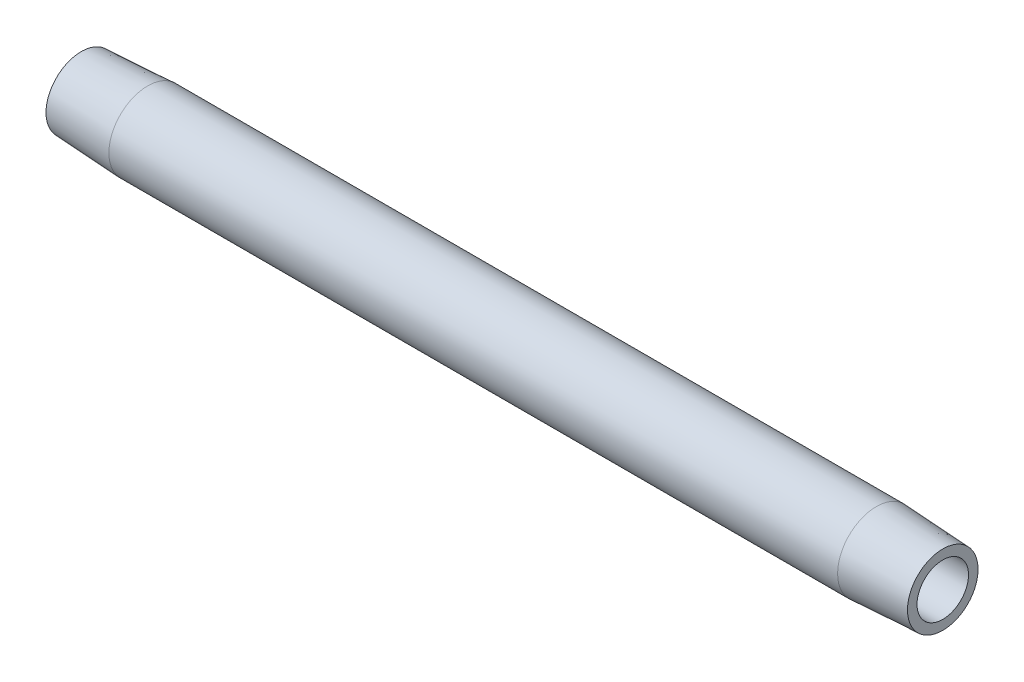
from build123d import *


with BuildPart() as part:
    # Sketch2 → Revolve1 (revolve)
    with BuildSketch(Plane.XY, mode=Mode.PRIVATE) as revolve1_sk:
        Polygon((8.810039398, 5.1435), (0, 4.6817854), (0, 3.4163), (114.3, 3.4163), (114.3, 4.6817854), (105.489960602, 5.1435), align=None)
    revolve(revolve1_sk.sketch.rotate(Axis((0.476141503, 0, 0), (1, 0, 0)), 90), axis=Axis((0.476141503, 0, 0), (1, 0, 0)))


solid = part.part
